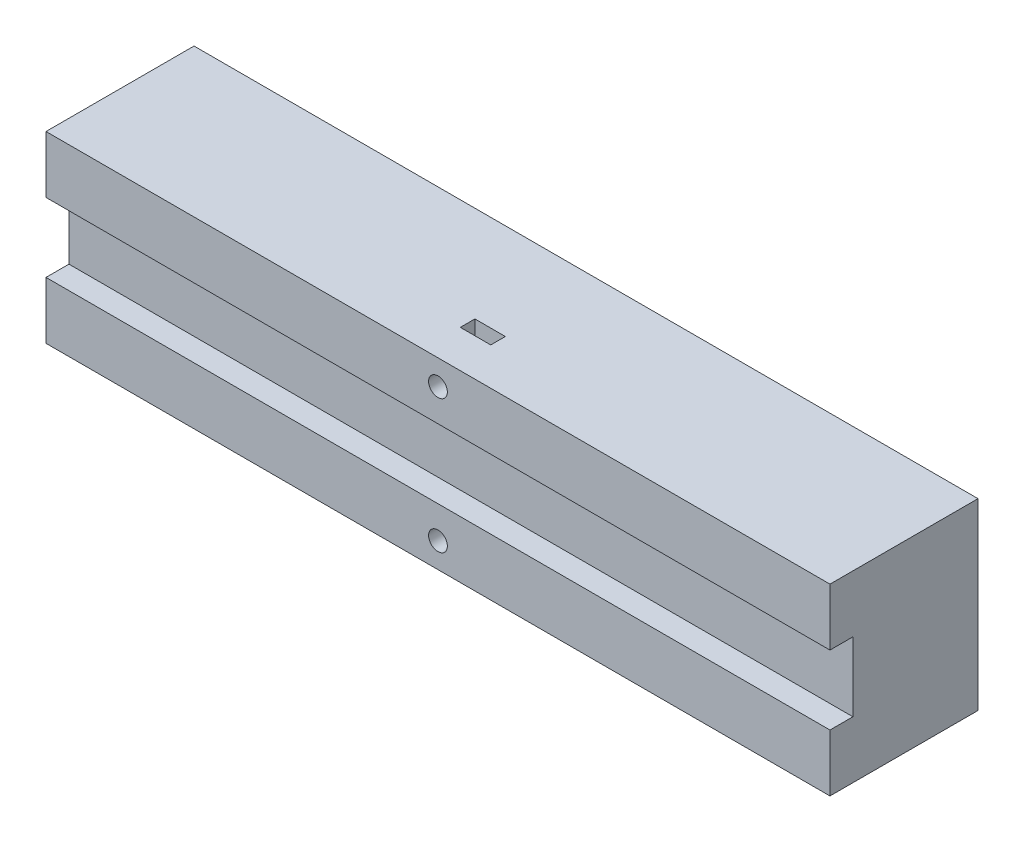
from build123d import *

# Parameters (mm, degrees)
SKETCH_1_W                                   = 188
SKETCH_1_H                                   = 44
SKETCH_1_R                                   = 2.25
RISER_BAND_1_DEPTH                           = 23
RISER_BAND_2_START                           = 23
RISER_BAND_2_DEPTH                           = 3.5
RISER_BAND_3_START                           = 26.5
SKETCH_3_W                                   = 188
SKETCH_3_H                                   = 44
SKETCH_3_R                                   = 2.25
RISER_BAND_3_DEPTH                           = 3.5
SIDE_RETENTION_LIPS_BELOW_OLD_RAIL_TOP_START = 30
SKETCH_4_W                                   = 188
SKETCH_4_H                                   = 13.7
SKETCH_4_R                                   = 2.25
SIDE_RETENTION_LIPS_BELOW_OLD_RAIL_TOP_DEPTH = 5.5


with BuildPart() as part:
    # Sketch 1 → Riser_band_1 (new body)
    with BuildSketch(Plane.XY):
        Rectangle(SKETCH_1_W, SKETCH_1_H)
        with Locations((0, -16)):
            Circle(SKETCH_1_R, mode=Mode.SUBTRACT)
        with Locations((0, 16)):
            Circle(SKETCH_1_R, mode=Mode.SUBTRACT)
    extrude(amount=RISER_BAND_1_DEPTH)

    # Sketch 2 → Riser_band_2 (add)
    with BuildSketch(Plane.XY.offset(RISER_BAND_2_START)):
        Polygon((-94, -22), (-3.65, -22), (-3.65, -11.75), (3.65, -11.75), (3.65, -22), (94, -22), (94, 22), (3.65, 22), (3.65, 11.75), (-3.65, 11.75), (-3.65, 22), (-94, 22), align=None)
    extrude(amount=RISER_BAND_2_DEPTH)

    # Sketch 3 → Riser_band_3 (add)
    with BuildSketch(Plane.XY.offset(RISER_BAND_3_START)):
        Rectangle(SKETCH_3_W, SKETCH_3_H)
        with Locations((0, -16)):
            Circle(SKETCH_3_R, mode=Mode.SUBTRACT)
        with Locations((0, 16)):
            Circle(SKETCH_3_R, mode=Mode.SUBTRACT)
    extrude(amount=RISER_BAND_3_DEPTH)

    # Sketch 4 → Side_retention_lips_below_old_rail_top (add)
    # profile 1 of 2: a face of its own
    with BuildSketch(Plane.XY.offset(SIDE_RETENTION_LIPS_BELOW_OLD_RAIL_TOP_START)):
        with Locations((0, -15.15)):
            Rectangle(SKETCH_4_W, SKETCH_4_H)
        with Locations((0, -16)):
            Circle(SKETCH_4_R, mode=Mode.SUBTRACT)
    # profile 2 of 2: a face of its own
    with BuildSketch(Plane.XY.offset(SIDE_RETENTION_LIPS_BELOW_OLD_RAIL_TOP_START)):
        with Locations((0, 15.15)):
            Rectangle(SKETCH_4_W, SKETCH_4_H)
        with Locations((0, 16)):
            Circle(SKETCH_4_R, mode=Mode.SUBTRACT)
    extrude(amount=SIDE_RETENTION_LIPS_BELOW_OLD_RAIL_TOP_DEPTH)


solid = part.part
